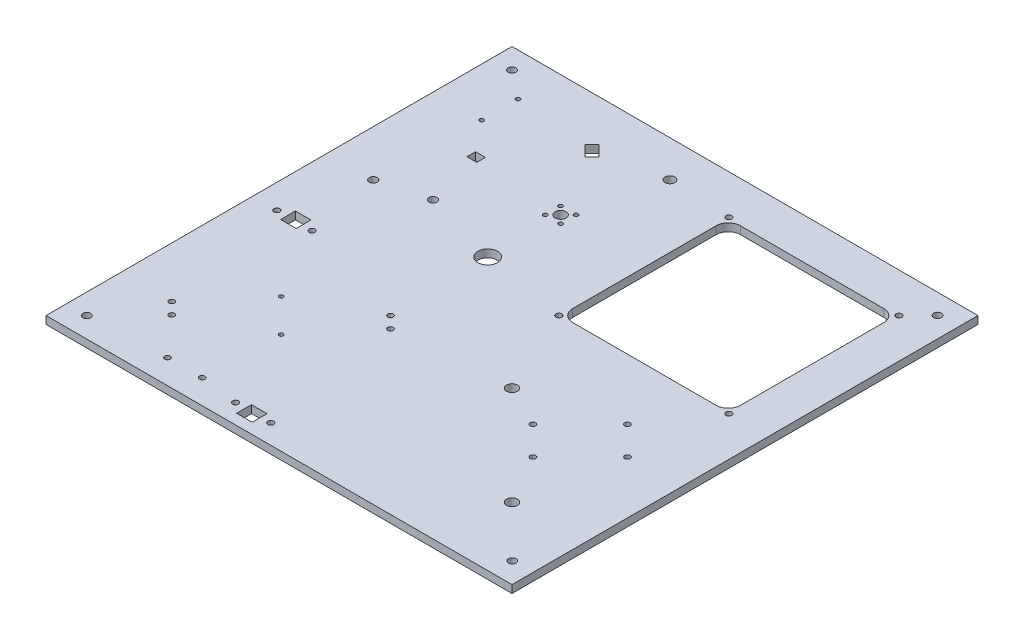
from build123d import *

# Parameters (mm, degrees)
SKETCH2_W                  = 383.54
SKETCH2_H                  = 383.54
BOSS_EXTRUDE2_DEPTH        = 6.35
M6_CLEARANCE_HOLE3_D       = 6.6
M8_CLEARANCE_HOLE2_D       = 10
F_1_4_0_2500_DOWEL_HOLE1_D = 6.35
M4_CLEARANCE_HOLE3_D       = 4.8
M4_CLEARANCE_HOLE3_DEPTH   = 8.99
M4_CLEARANCE_HOLE3_TIP     = 1.442065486
M8_CLEARANCE_HOLE1_D       = 9
M8_CLEARANCE_HOLE1_DEPTH   = 8.99
M8_CLEARANCE_HOLE1_TIP     = 2.703872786
M3_CLEARANCE_HOLE1_D       = 3.4
M3_CLEARANCE_HOLE1_DEPTH   = 8.99
M3_CLEARANCE_HOLE1_TIP     = 1.021463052
SKETCH19_R                 = 8.1
SKETCH19_R_2               = 4.06
SKETCH19_R_3               = 4.5
SKETCH19_W                 = 8.12
SKETCH19_H                 = 7.12
CUT_EXTRUDE1_DEPTH         = 272.278064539
M4_CLEARANCE_HOLE1_D       = 4.8
CUT_EXTRUDE2_DEPTH         = 272.278064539
M4_CLEARANCE_HOLE2_D       = 4.5
M4_CLEARANCE_HOLE2_DEPTH   = 8.99
M4_CLEARANCE_HOLE2_TIP     = 1.351936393
M6_CLEARANCE_HOLE5_D       = 6.6
M6_CLEARANCE_HOLE5_DEPTH   = 8.99
M6_CLEARANCE_HOLE5_TIP     = 1.982840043
SKETCH29_W                 = 12.8
SKETCH29_H                 = 12.2
CUT_EXTRUDE3_DEPTH         = 10
M4_CLEARANCE_HOLE4_D       = 4.5
M4_CLEARANCE_HOLE4_DEPTH   = 12.7
M4_CLEARANCE_HOLE4_TIP     = 1.351936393
M3_CLEARANCE_HOLE2_D       = 3.4
M3_CLEARANCE_HOLE2_DEPTH   = 12.7
M3_CLEARANCE_HOLE2_TIP     = 1.021463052
M4_CLEARANCE_HOLE5_D       = 4.5
M4_CLEARANCE_HOLE5_DEPTH   = 8.99
M4_CLEARANCE_HOLE5_TIP     = 1.351936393


with BuildPart() as part:
    # Sketch2 → Boss-Extrude2 (new body)
    with BuildSketch(Plane(origin=(0, 0, 0), x_dir=(1, 0, 0), z_dir=(0, 1, 0))):
        Rectangle(SKETCH2_W, SKETCH2_H)
    extrude(amount=BOSS_EXTRUDE2_DEPTH)

    # M6 Clearance Hole3 (through all)
    with Locations(Plane(origin=(0, 6.35, 0), x_dir=(1, 0, 0), z_dir=(0, 1, 0))):
        with Locations((51.77, 151.77), (151.77, 151.77), (101.77, 101.77), (51.77, 51.77), (76.77, 76.77), (101.77, 51.77)):
            Hole(M6_CLEARANCE_HOLE3_D / 2)

    # M8 Clearance Hole2 (through all)
    with Locations(Plane(origin=(0, 6.35, 0), x_dir=(1, 0, 0), z_dir=(0, 1, 0))):
        with Locations((126.77, 126.77), (26.77, 126.77), (151.77, 101.77), (126.77, 26.77), (76.77, 26.77), (26.77, 76.77)):
            Hole(M8_CLEARANCE_HOLE2_D / 2)

    # 1_4 _0.2500_ Dowel Hole1 (through all)
    with Locations(Plane(origin=(0, 6.35, 0), x_dir=(1, 0, 0), z_dir=(0, 1, 0))):
        with Locations((-175, -175), (-175, 175), (175, 175.23), (175, -174.77)):
            Hole(F_1_4_0_2500_DOWEL_HOLE1_D / 2)

    # M4 Clearance Hole3
    with Locations(Plane(origin=(0, 6.35, 0), x_dir=(1, 0, 0), z_dir=(0, 1, 0))):
        with Locations((-51.77, -175.77), (-22.77, -175.77), (-171.77, -21.77), (-142.77, -21.77)):
            Hole(M4_CLEARANCE_HOLE3_D / 2, depth=M4_CLEARANCE_HOLE3_DEPTH)
            with Locations((0, 0, -(M4_CLEARANCE_HOLE3_DEPTH + M4_CLEARANCE_HOLE3_TIP / 2))):  # 118° drill point
                Cone(0, M4_CLEARANCE_HOLE3_D / 2, M4_CLEARANCE_HOLE3_TIP, mode=Mode.SUBTRACT)

    # M8 Clearance Hole1
    with Locations(Plane(origin=(0, 6.35, 0), x_dir=(1, 0, 0), z_dir=(0, 1, 0))):
        with Locations((51.77, -51.77), (133.087279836, -133.087279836)):
            Hole(M8_CLEARANCE_HOLE1_D / 2, depth=M8_CLEARANCE_HOLE1_DEPTH)
            with Locations((0, 0, -(M8_CLEARANCE_HOLE1_DEPTH + M8_CLEARANCE_HOLE1_TIP / 2))):  # 118° drill point
                Cone(0, M8_CLEARANCE_HOLE1_D / 2, M8_CLEARANCE_HOLE1_TIP, mode=Mode.SUBTRACT)

    # M3 Clearance Hole1
    with Locations(Plane(origin=(0, 6.35, 0), x_dir=(1, 0, 0), z_dir=(0, 1, 0))):
        with Locations((-151.77, 156.77), (-151.77, 126.77), (-58.09, 85.44), (-45.44, 85.44), (-45.44, 98.09), (-58.09, 98.09)):
            Hole(M3_CLEARANCE_HOLE1_D / 2, depth=M3_CLEARANCE_HOLE1_DEPTH)
            with Locations((0, 0, -(M3_CLEARANCE_HOLE1_DEPTH + M3_CLEARANCE_HOLE1_TIP / 2))):  # 118° drill point
                Cone(0, M3_CLEARANCE_HOLE1_D / 2, M3_CLEARANCE_HOLE1_TIP, mode=Mode.SUBTRACT)

    # Sketch19 → Cut-Extrude1 (cut, through all)
    with BuildSketch(Plane(origin=(0, 6.35, 0), x_dir=(1, 0, 0), z_dir=(0, 1, 0))):
        with Locations(Location((-51.77, 31.77, 0), (0, 0, 270))):
            Circle(SKETCH19_R)
        with Locations(Location((-31.77, 161.77, 0), (0, 0, 270))):
            Circle(SKETCH19_R_2)
        with Locations(Location((-51.77, 91.77, 0), (0, 0, 270))):
            Circle(SKETCH19_R_3)
        Polygon((-91.77, 151.77), (-83.185723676, 143.185723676), (-77.444016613, 148.92743074), (-86.028292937, 157.511707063), align=None)
        with Locations((-127.71, 98.21)):
            Rectangle(SKETCH19_W, SKETCH19_H)
    extrude(amount=-CUT_EXTRUDE1_DEPTH, mode=Mode.SUBTRACT)

    # M4 Clearance Hole1 (through all)
    with Locations(Plane(origin=(0, 6.35, 0), x_dir=(1, 0, 0), z_dir=(0, 1, 0))):
        with Locations((159.27, 19.27), (19.27, 19.27), (19.27, 159.27), (159.27, 159.27), (89.27, 89.27)):
            Hole(M4_CLEARANCE_HOLE1_D / 2)

    # Sketch23 → Cut-Extrude2 (cut, through all)
    with BuildSketch(Plane(origin=(0, 6.35, 0), x_dir=(1, 0, 0), z_dir=(0, 1, 0))):
        with BuildLine():
            Line((30, 20), (148, 20))
            ThreePointArc((148, 20), (155.071067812, 22.928932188), (158, 30))
            Line((158, 30), (158, 148))
            ThreePointArc((158, 148), (155.071067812, 155.071067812), (148, 158))
            Line((148, 158), (30, 158))
            ThreePointArc((30, 158), (22.928932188, 155.071067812), (20, 148))
            Line((20, 148), (20, 30))
            ThreePointArc((20, 30), (22.928932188, 22.928932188), (30, 20))
        make_face()
    extrude(amount=-CUT_EXTRUDE2_DEPTH, mode=Mode.SUBTRACT)

    # M4 Clearance Hole2
    with Locations(Plane(origin=(0, 0, 0), x_dir=(-1, 0, 0), z_dir=(0, -1, 0))):
        with Locations((-148.334523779, -53.334523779), (-125, -30), (-109.443650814, -92.225396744), (-86.109127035, -68.890872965)):
            Hole(M4_CLEARANCE_HOLE2_D / 2, depth=M4_CLEARANCE_HOLE2_DEPTH)
            with Locations((0, 0, -(M4_CLEARANCE_HOLE2_DEPTH + M4_CLEARANCE_HOLE2_TIP / 2))):  # 118° drill point
                Cone(0, M4_CLEARANCE_HOLE2_D / 2, M4_CLEARANCE_HOLE2_TIP, mode=Mode.SUBTRACT)

    # M6 Clearance Hole5
    with Locations(Plane(origin=(0, 6.35, 0), x_dir=(1, 0, 0), z_dir=(0, 1, 0))):
        with Locations((-115, 50), (-153.830218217, 39.595474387)):
            Hole(M6_CLEARANCE_HOLE5_D / 2, depth=M6_CLEARANCE_HOLE5_DEPTH)
            with Locations((0, 0, -(M6_CLEARANCE_HOLE5_DEPTH + M6_CLEARANCE_HOLE5_TIP / 2))):  # 118° drill point
                Cone(0, M6_CLEARANCE_HOLE5_D / 2, M6_CLEARANCE_HOLE5_TIP, mode=Mode.SUBTRACT)

    # Sketch29 → Cut-Extrude3 (cut)
    with BuildSketch(Plane(origin=(0, 6.35, 0), x_dir=(1, 0, 0), z_dir=(0, 1, 0))):
        with Locations((-37.27, -176.87)):
            Rectangle(SKETCH29_W, SKETCH29_H)
        with Locations((-157.27, -20.67)):
            Rectangle(SKETCH29_W, SKETCH29_H)
    extrude(amount=-CUT_EXTRUDE3_DEPTH, mode=Mode.SUBTRACT)

    # M4 Clearance Hole4
    with Locations(Plane(origin=(0, 6.35, 0), x_dir=(1, 0, 0), z_dir=(0, 1, 0))):
        with Locations((-40.454058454, -59.545941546), (-50, -50), (-140.454058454, -139.545941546), (-150, -130)):
            Hole(M4_CLEARANCE_HOLE4_D / 2, depth=M4_CLEARANCE_HOLE4_DEPTH)
            with Locations((0, 0, -(M4_CLEARANCE_HOLE4_DEPTH + M4_CLEARANCE_HOLE4_TIP / 2))):  # 118° drill point
                Cone(0, M4_CLEARANCE_HOLE4_D / 2, M4_CLEARANCE_HOLE4_TIP, mode=Mode.SUBTRACT)

    # M3 Clearance Hole2
    with Locations(Plane(origin=(0, 6.35, 0), x_dir=(1, 0, 0), z_dir=(0, 1, 0))):
        with Locations((-108.611805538, -81.388194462), (-81.388194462, -108.611805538)):
            Hole(M3_CLEARANCE_HOLE2_D / 2, depth=M3_CLEARANCE_HOLE2_DEPTH)
            with Locations((0, 0, -(M3_CLEARANCE_HOLE2_DEPTH + M3_CLEARANCE_HOLE2_TIP / 2))):  # 118° drill point
                Cone(0, M3_CLEARANCE_HOLE2_D / 2, M3_CLEARANCE_HOLE2_TIP, mode=Mode.SUBTRACT)

    # M4 Clearance Hole5
    with Locations(Plane(origin=(0, 0, 0), x_dir=(-1, 0, 0), z_dir=(0, -1, 0))):
        with Locations((83.27, -171.77), (111.77, -171.77)):
            Hole(M4_CLEARANCE_HOLE5_D / 2, depth=M4_CLEARANCE_HOLE5_DEPTH)
            with Locations((0, 0, -(M4_CLEARANCE_HOLE5_DEPTH + M4_CLEARANCE_HOLE5_TIP / 2))):  # 118° drill point
                Cone(0, M4_CLEARANCE_HOLE5_D / 2, M4_CLEARANCE_HOLE5_TIP, mode=Mode.SUBTRACT)


solid = part.part
